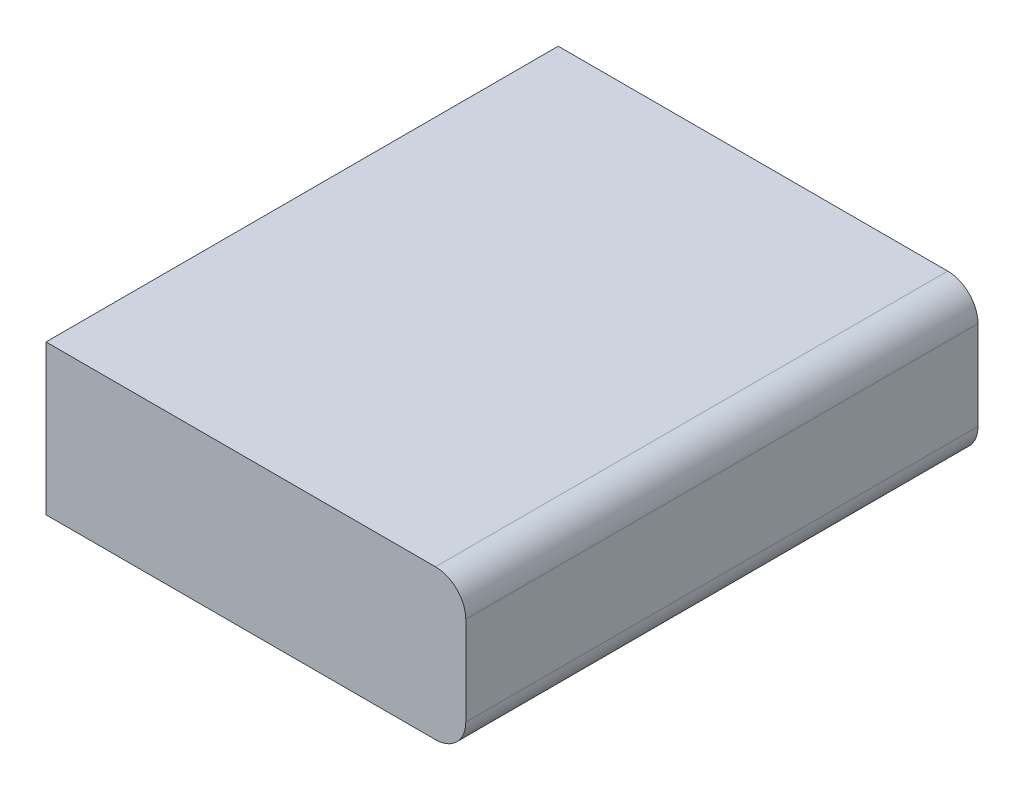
ISO-10303-21;
HEADER;
FILE_DESCRIPTION(('STEP AP214'),'2;1');
FILE_NAME('part.step','',(''),(''),'','','');
FILE_SCHEMA(('AUTOMOTIVE_DESIGN { 1 0 10303 214 1 1 1 1 }'));
ENDSEC;
DATA;
#1=APPLICATION_CONTEXT('core data for automotive mechanical design processes');
#2=APPLICATION_PROTOCOL_DEFINITION('international standard','automotive_design',2000,#1);
#3=PRODUCT_CONTEXT('',#1,'mechanical');
#4=PRODUCT('Part','Part','',(#3));
#5=PRODUCT_RELATED_PRODUCT_CATEGORY('part','',(#4));
#6=PRODUCT_DEFINITION_FORMATION('','',#4);
#7=PRODUCT_DEFINITION_CONTEXT('part definition',#1,'design');
#8=PRODUCT_DEFINITION('design','',#6,#7);
#9=PRODUCT_DEFINITION_SHAPE('','',#8);
#10=(LENGTH_UNIT() NAMED_UNIT(*) SI_UNIT(.MILLI.,.METRE.));
#11=(NAMED_UNIT(*) PLANE_ANGLE_UNIT() SI_UNIT($,.RADIAN.));
#12=(NAMED_UNIT(*) SI_UNIT($,.STERADIAN.) SOLID_ANGLE_UNIT());
#13=UNCERTAINTY_MEASURE_WITH_UNIT(LENGTH_MEASURE(1.E-05),#10,'distance_accuracy_value','');
#14=(GEOMETRIC_REPRESENTATION_CONTEXT(3) GLOBAL_UNCERTAINTY_ASSIGNED_CONTEXT((#13)) GLOBAL_UNIT_ASSIGNED_CONTEXT((#10,
#11,#12)) REPRESENTATION_CONTEXT('',''));
#15=CARTESIAN_POINT('',(0.,0.,0.));
#16=DIRECTION('',(0.,0.,1.));
#17=DIRECTION('',(1.,0.,0.));
#18=AXIS2_PLACEMENT_3D('',#15,#16,#17);
#19=CARTESIAN_POINT('',(-108.694413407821,25.0449720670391,169.));
#20=DIRECTION('',(1.,0.,0.));
#21=DIRECTION('',(0.,1.,0.));
#22=AXIS2_PLACEMENT_3D('',#19,#20,#21);
#23=PLANE('',#22);
#24=DIRECTION('',(0.,0.,-1.));
#25=VECTOR('',#24,1.);
#26=CARTESIAN_POINT('',(-108.694413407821,18.0449720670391,86.));
#27=LINE('',#26,#25);
#28=CARTESIAN_POINT('',(-108.694413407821,18.0449720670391,86.));
#29=VERTEX_POINT('',#28);
#30=CARTESIAN_POINT('',(-108.694413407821,18.0449720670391,30.));
#31=VERTEX_POINT('',#30);
#32=EDGE_CURVE('E142',#29,#31,#27,.T.);
#33=ORIENTED_EDGE('',*,*,#32,.F.);
#34=DIRECTION('',(0.,1.,0.));
#35=VECTOR('',#34,1.);
#36=CARTESIAN_POINT('',(-108.694413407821,18.0449720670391,86.));
#37=LINE('',#36,#35);
#38=CARTESIAN_POINT('',(-108.694413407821,-1.95502793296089,86.));
#39=VERTEX_POINT('',#38);
#40=EDGE_CURVE('E50',#39,#29,#37,.T.);
#41=ORIENTED_EDGE('',*,*,#40,.F.);
#42=DIRECTION('',(0.,0.,1.));
#43=VECTOR('',#42,1.);
#44=CARTESIAN_POINT('',(-108.694413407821,-1.95502793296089,86.));
#45=LINE('',#44,#43);
#46=CARTESIAN_POINT('',(-108.694413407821,-1.9550279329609,30.));
#47=VERTEX_POINT('',#46);
#48=EDGE_CURVE('E131',#47,#39,#45,.T.);
#49=ORIENTED_EDGE('',*,*,#48,.F.);
#50=DIRECTION('',(0.,-1.,0.));
#51=VECTOR('',#50,1.);
#52=CARTESIAN_POINT('',(-108.694413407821,18.0449720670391,30.));
#53=LINE('',#52,#51);
#54=EDGE_CURVE('E134',#31,#47,#53,.T.);
#55=ORIENTED_EDGE('',*,*,#54,.F.);
#56=EDGE_LOOP('',(#33,#41,#49,#55));
#57=FACE_BOUND('',#56,.T.);
#58=DIRECTION('',(0.,-1.,0.));
#59=VECTOR('',#58,1.);
#60=CARTESIAN_POINT('',(-108.694413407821,25.0449720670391,0.));
#61=LINE('',#60,#59);
#62=CARTESIAN_POINT('',(-108.694413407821,25.0449720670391,0.));
#63=VERTEX_POINT('',#62);
#64=CARTESIAN_POINT('',(-108.694413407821,-24.3550279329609,0.));
#65=VERTEX_POINT('',#64);
#66=EDGE_CURVE('E148',#63,#65,#61,.T.);
#67=ORIENTED_EDGE('',*,*,#66,.T.);
#68=DIRECTION('',(0.,0.,-1.));
#69=VECTOR('',#68,1.);
#70=CARTESIAN_POINT('',(-108.694413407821,-24.3550279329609,169.));
#71=LINE('',#70,#69);
#72=CARTESIAN_POINT('',(-108.694413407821,-24.3550279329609,169.));
#73=VERTEX_POINT('',#72);
#74=EDGE_CURVE('E174',#73,#65,#71,.T.);
#75=ORIENTED_EDGE('',*,*,#74,.F.);
#76=DIRECTION('',(0.,-1.,0.));
#77=VECTOR('',#76,1.);
#78=CARTESIAN_POINT('',(-108.694413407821,25.0449720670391,169.));
#79=LINE('',#78,#77);
#80=CARTESIAN_POINT('',(-108.694413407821,25.0449720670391,169.));
#81=VERTEX_POINT('',#80);
#82=EDGE_CURVE('E152',#81,#73,#79,.T.);
#83=ORIENTED_EDGE('',*,*,#82,.F.);
#84=DIRECTION('',(0.,0.,-1.));
#85=VECTOR('',#84,1.);
#86=CARTESIAN_POINT('',(-108.694413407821,25.0449720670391,169.));
#87=LINE('',#86,#85);
#88=EDGE_CURVE('E163',#81,#63,#87,.T.);
#89=ORIENTED_EDGE('',*,*,#88,.T.);
#90=EDGE_LOOP('',(#67,#75,#83,#89));
#91=FACE_BOUND('',#90,.T.);
#92=ADVANCED_FACE('F34',(#57,#91),#23,.F.);
#93=CARTESIAN_POINT('',(-108.694413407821,-24.3550279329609,169.));
#94=DIRECTION('',(0.,1.,0.));
#95=DIRECTION('',(-1.,0.,0.));
#96=AXIS2_PLACEMENT_3D('',#93,#94,#95);
#97=PLANE('',#96);
#98=DIRECTION('',(1.,0.,0.));
#99=VECTOR('',#98,1.);
#100=CARTESIAN_POINT('',(-108.694413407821,-24.3550279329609,0.));
#101=LINE('',#100,#99);
#102=CARTESIAN_POINT('',(19.8055865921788,-24.3550279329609,0.));
#103=VERTEX_POINT('',#102);
#104=EDGE_CURVE('E166',#65,#103,#101,.T.);
#105=ORIENTED_EDGE('',*,*,#104,.T.);
#106=DIRECTION('',(0.,0.,-1.));
#107=VECTOR('',#106,1.);
#108=CARTESIAN_POINT('',(19.8055865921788,-24.3550279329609,169.));
#109=LINE('',#108,#107);
#110=CARTESIAN_POINT('',(19.8055865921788,-24.3550279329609,169.));
#111=VERTEX_POINT('',#110);
#112=EDGE_CURVE('E11',#103,#111,#109,.F.);
#113=ORIENTED_EDGE('',*,*,#112,.T.);
#114=DIRECTION('',(1.,0.,0.));
#115=VECTOR('',#114,1.);
#116=CARTESIAN_POINT('',(-108.694413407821,-24.3550279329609,169.));
#117=LINE('',#116,#115);
#118=EDGE_CURVE('E155',#73,#111,#117,.T.);
#119=ORIENTED_EDGE('',*,*,#118,.F.);
#120=ORIENTED_EDGE('',*,*,#74,.T.);
#121=EDGE_LOOP('',(#105,#113,#119,#120));
#122=FACE_BOUND('',#121,.T.);
#123=ADVANCED_FACE('F214',(#122),#97,.F.);
#124=CARTESIAN_POINT('',(29.8055865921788,25.0449720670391,169.));
#125=DIRECTION('',(-1.,0.,0.));
#126=DIRECTION('',(0.,0.,1.));
#127=AXIS2_PLACEMENT_3D('',#124,#125,#126);
#128=PLANE('',#127);
#129=DIRECTION('',(0.,1.,0.));
#130=VECTOR('',#129,1.);
#131=CARTESIAN_POINT('',(29.8055865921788,25.0449720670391,0.));
#132=LINE('',#131,#130);
#133=CARTESIAN_POINT('',(29.8055865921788,-14.3550279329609,0.));
#134=VERTEX_POINT('',#133);
#135=CARTESIAN_POINT('',(29.8055865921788,15.0449720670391,0.));
#136=VERTEX_POINT('',#135);
#137=EDGE_CURVE('E168',#134,#136,#132,.T.);
#138=ORIENTED_EDGE('',*,*,#137,.T.);
#139=DIRECTION('',(0.,0.,-1.));
#140=VECTOR('',#139,1.);
#141=CARTESIAN_POINT('',(29.8055865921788,15.0449720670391,169.));
#142=LINE('',#141,#140);
#143=CARTESIAN_POINT('',(29.8055865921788,15.0449720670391,169.));
#144=VERTEX_POINT('',#143);
#145=EDGE_CURVE('E187',#136,#144,#142,.F.);
#146=ORIENTED_EDGE('',*,*,#145,.T.);
#147=DIRECTION('',(0.,1.,0.));
#148=VECTOR('',#147,1.);
#149=CARTESIAN_POINT('',(29.8055865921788,25.0449720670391,169.));
#150=LINE('',#149,#148);
#151=CARTESIAN_POINT('',(29.8055865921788,-14.3550279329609,169.));
#152=VERTEX_POINT('',#151);
#153=EDGE_CURVE('E158',#152,#144,#150,.T.);
#154=ORIENTED_EDGE('',*,*,#153,.F.);
#155=DIRECTION('',(0.,0.,-1.));
#156=VECTOR('',#155,1.);
#157=CARTESIAN_POINT('',(29.8055865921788,-14.3550279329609,169.));
#158=LINE('',#157,#156);
#159=EDGE_CURVE('E184',#152,#134,#158,.T.);
#160=ORIENTED_EDGE('',*,*,#159,.T.);
#161=EDGE_LOOP('',(#138,#146,#154,#160));
#162=FACE_BOUND('',#161,.T.);
#163=ADVANCED_FACE('F210',(#162),#128,.F.);
#164=CARTESIAN_POINT('',(-108.694413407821,25.0449720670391,169.));
#165=DIRECTION('',(0.,-1.,0.));
#166=DIRECTION('',(0.,0.,-1.));
#167=AXIS2_PLACEMENT_3D('',#164,#165,#166);
#168=PLANE('',#167);
#169=DIRECTION('',(-1.,0.,0.));
#170=VECTOR('',#169,1.);
#171=CARTESIAN_POINT('',(-108.694413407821,25.0449720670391,169.));
#172=LINE('',#171,#170);
#173=CARTESIAN_POINT('',(19.8055865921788,25.0449720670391,169.));
#174=VERTEX_POINT('',#173);
#175=EDGE_CURVE('E161',#174,#81,#172,.T.);
#176=ORIENTED_EDGE('',*,*,#175,.F.);
#177=DIRECTION('',(0.,0.,-1.));
#178=VECTOR('',#177,1.);
#179=CARTESIAN_POINT('',(19.8055865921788,25.0449720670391,169.));
#180=LINE('',#179,#178);
#181=CARTESIAN_POINT('',(19.8055865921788,25.0449720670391,0.));
#182=VERTEX_POINT('',#181);
#183=EDGE_CURVE('E177',#174,#182,#180,.T.);
#184=ORIENTED_EDGE('',*,*,#183,.T.);
#185=DIRECTION('',(-1.,0.,0.));
#186=VECTOR('',#185,1.);
#187=CARTESIAN_POINT('',(-108.694413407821,25.0449720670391,0.));
#188=LINE('',#187,#186);
#189=EDGE_CURVE('E156',#182,#63,#188,.T.);
#190=ORIENTED_EDGE('',*,*,#189,.T.);
#191=ORIENTED_EDGE('',*,*,#88,.F.);
#192=EDGE_LOOP('',(#176,#184,#190,#191));
#193=FACE_BOUND('',#192,.T.);
#194=ADVANCED_FACE('F201',(#193),#168,.F.);
#195=CARTESIAN_POINT('',(0.,0.,169.));
#196=DIRECTION('',(0.,0.,1.));
#197=DIRECTION('',(1.,0.,0.));
#198=AXIS2_PLACEMENT_3D('',#195,#196,#197);
#199=PLANE('',#198);
#200=ORIENTED_EDGE('',*,*,#153,.T.);
#201=CARTESIAN_POINT('',(19.8055865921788,15.0449720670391,169.));
#202=DIRECTION('',(0.,0.,1.));
#203=DIRECTION('',(1.,0.,0.));
#204=AXIS2_PLACEMENT_3D('',#201,#202,#203);
#205=CIRCLE('',#204,10.);
#206=EDGE_CURVE('E43',#144,#174,#205,.T.);
#207=ORIENTED_EDGE('',*,*,#206,.T.);
#208=ORIENTED_EDGE('',*,*,#175,.T.);
#209=ORIENTED_EDGE('',*,*,#82,.T.);
#210=ORIENTED_EDGE('',*,*,#118,.T.);
#211=CARTESIAN_POINT('',(19.8055865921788,-14.3550279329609,169.));
#212=DIRECTION('',(0.,0.,1.));
#213=DIRECTION('',(1.,0.,0.));
#214=AXIS2_PLACEMENT_3D('',#211,#212,#213);
#215=CIRCLE('',#214,10.);
#216=EDGE_CURVE('E189',#111,#152,#215,.T.);
#217=ORIENTED_EDGE('',*,*,#216,.T.);
#218=EDGE_LOOP('',(#200,#207,#208,#209,#210,#217));
#219=FACE_BOUND('',#218,.T.);
#220=ADVANCED_FACE('F194',(#219),#199,.T.);
#221=CARTESIAN_POINT('',(0.,0.,0.));
#222=DIRECTION('',(0.,0.,1.));
#223=DIRECTION('',(1.,0.,0.));
#224=AXIS2_PLACEMENT_3D('',#221,#222,#223);
#225=PLANE('',#224);
#226=ORIENTED_EDGE('',*,*,#189,.F.);
#227=CARTESIAN_POINT('',(19.8055865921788,15.0449720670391,0.));
#228=DIRECTION('',(0.,0.,1.));
#229=DIRECTION('',(1.,0.,0.));
#230=AXIS2_PLACEMENT_3D('',#227,#228,#229);
#231=CIRCLE('',#230,10.);
#232=EDGE_CURVE('E182',#182,#136,#231,.F.);
#233=ORIENTED_EDGE('',*,*,#232,.T.);
#234=ORIENTED_EDGE('',*,*,#137,.F.);
#235=CARTESIAN_POINT('',(19.8055865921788,-14.3550279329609,0.));
#236=DIRECTION('',(0.,0.,1.));
#237=DIRECTION('',(1.,0.,0.));
#238=AXIS2_PLACEMENT_3D('',#235,#236,#237);
#239=CIRCLE('',#238,10.);
#240=EDGE_CURVE('E180',#134,#103,#239,.F.);
#241=ORIENTED_EDGE('',*,*,#240,.T.);
#242=ORIENTED_EDGE('',*,*,#104,.F.);
#243=ORIENTED_EDGE('',*,*,#66,.F.);
#244=EDGE_LOOP('',(#226,#233,#234,#241,#242,#243));
#245=FACE_BOUND('',#244,.T.);
#246=ADVANCED_FACE('F207',(#245),#225,.F.);
#247=CARTESIAN_POINT('',(19.8055865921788,15.0449720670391,169.));
#248=DIRECTION('',(0.,0.,-1.));
#249=DIRECTION('',(-1.,0.,0.));
#250=AXIS2_PLACEMENT_3D('',#247,#248,#249);
#251=CYLINDRICAL_SURFACE('',#250,10.);
#252=ORIENTED_EDGE('',*,*,#206,.F.);
#253=ORIENTED_EDGE('',*,*,#145,.F.);
#254=ORIENTED_EDGE('',*,*,#232,.F.);
#255=ORIENTED_EDGE('',*,*,#183,.F.);
#256=EDGE_LOOP('',(#252,#253,#254,#255));
#257=FACE_BOUND('',#256,.T.);
#258=ADVANCED_FACE('F204',(#257),#251,.T.);
#259=CARTESIAN_POINT('',(19.8055865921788,-14.3550279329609,169.));
#260=DIRECTION('',(0.,0.,-1.));
#261=DIRECTION('',(-1.,0.,0.));
#262=AXIS2_PLACEMENT_3D('',#259,#260,#261);
#263=CYLINDRICAL_SURFACE('',#262,10.);
#264=ORIENTED_EDGE('',*,*,#216,.F.);
#265=ORIENTED_EDGE('',*,*,#112,.F.);
#266=ORIENTED_EDGE('',*,*,#240,.F.);
#267=ORIENTED_EDGE('',*,*,#159,.F.);
#268=EDGE_LOOP('',(#264,#265,#266,#267));
#269=FACE_BOUND('',#268,.T.);
#270=ADVANCED_FACE('F36',(#269),#263,.T.);
#271=CARTESIAN_POINT('',(-107.694413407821,18.0449720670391,86.));
#272=DIRECTION('',(0.,0.,1.));
#273=DIRECTION('',(1.,0.,0.));
#274=AXIS2_PLACEMENT_3D('',#271,#272,#273);
#275=PLANE('',#274);
#276=ORIENTED_EDGE('',*,*,#40,.T.);
#277=DIRECTION('',(-1.,0.,0.));
#278=VECTOR('',#277,1.);
#279=CARTESIAN_POINT('',(-107.694413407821,18.0449720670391,86.));
#280=LINE('',#279,#278);
#281=CARTESIAN_POINT('',(-107.694413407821,18.0449720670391,86.));
#282=VERTEX_POINT('',#281);
#283=EDGE_CURVE('E109',#282,#29,#280,.T.);
#284=ORIENTED_EDGE('',*,*,#283,.F.);
#285=DIRECTION('',(0.,1.,0.));
#286=VECTOR('',#285,1.);
#287=CARTESIAN_POINT('',(-107.694413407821,18.0449720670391,86.));
#288=LINE('',#287,#286);
#289=CARTESIAN_POINT('',(-107.694413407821,-1.95502793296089,86.));
#290=VERTEX_POINT('',#289);
#291=EDGE_CURVE('E113',#290,#282,#288,.T.);
#292=ORIENTED_EDGE('',*,*,#291,.F.);
#293=DIRECTION('',(-1.,0.,0.));
#294=VECTOR('',#293,1.);
#295=CARTESIAN_POINT('',(-107.694413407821,-1.95502793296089,86.));
#296=LINE('',#295,#294);
#297=EDGE_CURVE('E146',#290,#39,#296,.T.);
#298=ORIENTED_EDGE('',*,*,#297,.T.);
#299=EDGE_LOOP('',(#276,#284,#292,#298));
#300=FACE_BOUND('',#299,.T.);
#301=ADVANCED_FACE('F111',(#300),#275,.F.);
#302=CARTESIAN_POINT('',(-107.694413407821,-1.95502793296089,86.));
#303=DIRECTION('',(0.,-1.,0.));
#304=DIRECTION('',(1.,0.,0.));
#305=AXIS2_PLACEMENT_3D('',#302,#303,#304);
#306=PLANE('',#305);
#307=ORIENTED_EDGE('',*,*,#48,.T.);
#308=ORIENTED_EDGE('',*,*,#297,.F.);
#309=DIRECTION('',(0.,0.,1.));
#310=VECTOR('',#309,1.);
#311=CARTESIAN_POINT('',(-107.694413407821,-1.95502793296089,86.));
#312=LINE('',#311,#310);
#313=CARTESIAN_POINT('',(-107.694413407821,-1.9550279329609,30.));
#314=VERTEX_POINT('',#313);
#315=EDGE_CURVE('E119',#314,#290,#312,.T.);
#316=ORIENTED_EDGE('',*,*,#315,.F.);
#317=DIRECTION('',(-1.,0.,0.));
#318=VECTOR('',#317,1.);
#319=CARTESIAN_POINT('',(-107.694413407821,-1.9550279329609,30.));
#320=LINE('',#319,#318);
#321=EDGE_CURVE('E149',#314,#47,#320,.T.);
#322=ORIENTED_EDGE('',*,*,#321,.T.);
#323=EDGE_LOOP('',(#307,#308,#316,#322));
#324=FACE_BOUND('',#323,.T.);
#325=ADVANCED_FACE('F278',(#324),#306,.F.);
#326=CARTESIAN_POINT('',(-107.694413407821,18.0449720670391,30.));
#327=DIRECTION('',(0.,0.,-1.));
#328=DIRECTION('',(-1.,0.,0.));
#329=AXIS2_PLACEMENT_3D('',#326,#327,#328);
#330=PLANE('',#329);
#331=ORIENTED_EDGE('',*,*,#54,.T.);
#332=ORIENTED_EDGE('',*,*,#321,.F.);
#333=DIRECTION('',(0.,-1.,0.));
#334=VECTOR('',#333,1.);
#335=CARTESIAN_POINT('',(-107.694413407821,18.0449720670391,30.));
#336=LINE('',#335,#334);
#337=CARTESIAN_POINT('',(-107.694413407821,18.0449720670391,30.));
#338=VERTEX_POINT('',#337);
#339=EDGE_CURVE('E127',#338,#314,#336,.T.);
#340=ORIENTED_EDGE('',*,*,#339,.F.);
#341=DIRECTION('',(-1.,0.,0.));
#342=VECTOR('',#341,1.);
#343=CARTESIAN_POINT('',(-107.694413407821,18.0449720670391,30.));
#344=LINE('',#343,#342);
#345=EDGE_CURVE('E118',#338,#31,#344,.T.);
#346=ORIENTED_EDGE('',*,*,#345,.T.);
#347=EDGE_LOOP('',(#331,#332,#340,#346));
#348=FACE_BOUND('',#347,.T.);
#349=ADVANCED_FACE('F283',(#348),#330,.F.);
#350=CARTESIAN_POINT('',(-107.694413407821,18.0449720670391,86.));
#351=DIRECTION('',(0.,1.,0.));
#352=DIRECTION('',(-1.,0.,0.));
#353=AXIS2_PLACEMENT_3D('',#350,#351,#352);
#354=PLANE('',#353);
#355=ORIENTED_EDGE('',*,*,#32,.T.);
#356=ORIENTED_EDGE('',*,*,#345,.F.);
#357=DIRECTION('',(0.,0.,-1.));
#358=VECTOR('',#357,1.);
#359=CARTESIAN_POINT('',(-107.694413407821,18.0449720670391,86.));
#360=LINE('',#359,#358);
#361=EDGE_CURVE('E122',#282,#338,#360,.T.);
#362=ORIENTED_EDGE('',*,*,#361,.F.);
#363=ORIENTED_EDGE('',*,*,#283,.T.);
#364=EDGE_LOOP('',(#355,#356,#362,#363));
#365=FACE_BOUND('',#364,.T.);
#366=ADVANCED_FACE('F123',(#365),#354,.F.);
#367=CARTESIAN_POINT('',(-107.694413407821,0.,0.));
#368=DIRECTION('',(1.,0.,0.));
#369=DIRECTION('',(0.,0.,-1.));
#370=AXIS2_PLACEMENT_3D('',#367,#368,#369);
#371=PLANE('',#370);
#372=CARTESIAN_POINT('',(-107.694413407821,13.0449720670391,35.));
#373=DIRECTION('',(1.,0.,0.));
#374=DIRECTION('',(0.,0.,-1.));
#375=AXIS2_PLACEMENT_3D('',#372,#373,#374);
#376=CIRCLE('',#375,3.50000000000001);
#377=CARTESIAN_POINT('',(-107.694413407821,13.0449720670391,31.5));
#378=VERTEX_POINT('',#377);
#379=EDGE_CURVE('E38',#378,#378,#376,.T.);
#380=ORIENTED_EDGE('',*,*,#379,.T.);
#381=EDGE_LOOP('',(#380));
#382=FACE_BOUND('',#381,.T.);
#383=ORIENTED_EDGE('',*,*,#291,.T.);
#384=ORIENTED_EDGE('',*,*,#361,.T.);
#385=ORIENTED_EDGE('',*,*,#339,.T.);
#386=ORIENTED_EDGE('',*,*,#315,.T.);
#387=EDGE_LOOP('',(#383,#384,#385,#386));
#388=FACE_BOUND('',#387,.T.);
#389=ADVANCED_FACE('F129',(#382,#388),#371,.F.);
#390=CARTESIAN_POINT('',(-98.6944134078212,13.0449720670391,35.));
#391=DIRECTION('',(-1.,0.,0.));
#392=DIRECTION('',(0.,-1.,0.));
#393=AXIS2_PLACEMENT_3D('',#390,#391,#392);
#394=CYLINDRICAL_SURFACE('',#393,3.50000000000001);
#395=CARTESIAN_POINT('',(-98.6944134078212,13.0449720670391,35.));
#396=DIRECTION('',(-1.,0.,0.));
#397=DIRECTION('',(0.,-1.,0.));
#398=AXIS2_PLACEMENT_3D('',#395,#396,#397);
#399=CIRCLE('',#398,3.50000000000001);
#400=CARTESIAN_POINT('',(-98.6944134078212,9.5449720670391,35.));
#401=VERTEX_POINT('',#400);
#402=EDGE_CURVE('E137',#401,#401,#399,.T.);
#403=ORIENTED_EDGE('',*,*,#402,.F.);
#404=EDGE_LOOP('',(#403));
#405=FACE_BOUND('',#404,.T.);
#406=ORIENTED_EDGE('',*,*,#379,.F.);
#407=EDGE_LOOP('',(#406));
#408=FACE_BOUND('',#407,.T.);
#409=ADVANCED_FACE('F304',(#405,#408),#394,.F.);
#410=CARTESIAN_POINT('',(-98.6944134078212,13.0449720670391,35.));
#411=DIRECTION('',(-1.,0.,0.));
#412=DIRECTION('',(0.,-1.,0.));
#413=AXIS2_PLACEMENT_3D('',#410,#411,#412);
#414=PLANE('',#413);
#415=ORIENTED_EDGE('',*,*,#402,.T.);
#416=EDGE_LOOP('',(#415));
#417=FACE_BOUND('',#416,.T.);
#418=ADVANCED_FACE('F312',(#417),#414,.T.);
#419=CLOSED_SHELL('',(#92,#123,#163,#194,#220,#246,#258,#270,#301,#325,#349,#366,#389,#409,#418));
#420=MANIFOLD_SOLID_BREP('B2',#419);
#421=ADVANCED_BREP_SHAPE_REPRESENTATION('',(#18,#420),#14);
#422=SHAPE_DEFINITION_REPRESENTATION(#9,#421);
ENDSEC;
END-ISO-10303-21;
